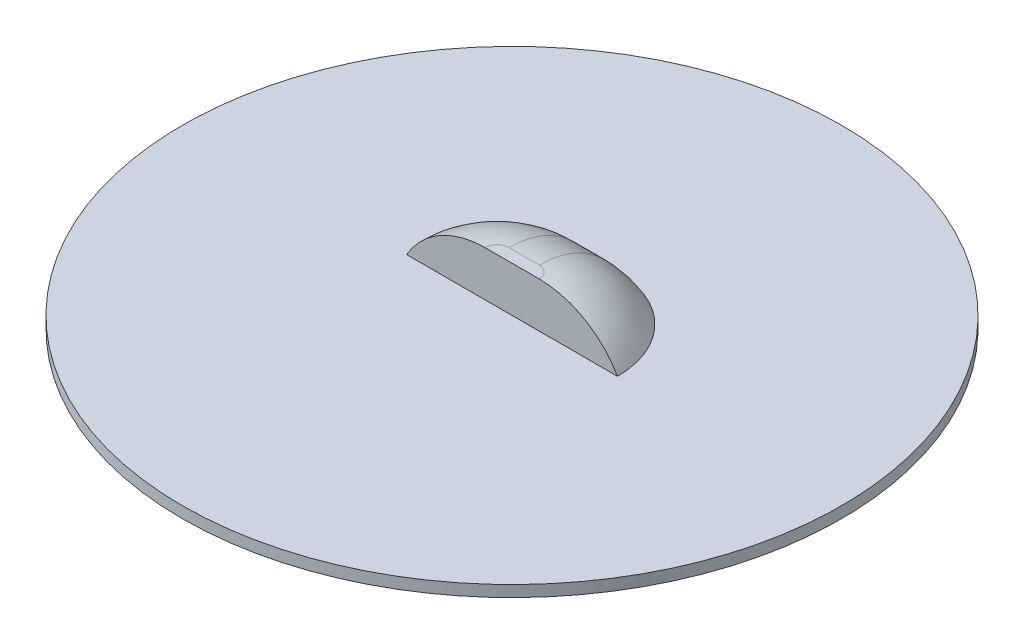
ISO-10303-21;
HEADER;
FILE_DESCRIPTION(('STEP AP214'),'2;1');
FILE_NAME('part.step','',(''),(''),'','','');
FILE_SCHEMA(('AUTOMOTIVE_DESIGN { 1 0 10303 214 1 1 1 1 }'));
ENDSEC;
DATA;
#1=APPLICATION_CONTEXT('core data for automotive mechanical design processes');
#2=APPLICATION_PROTOCOL_DEFINITION('international standard','automotive_design',2000,#1);
#3=PRODUCT_CONTEXT('',#1,'mechanical');
#4=PRODUCT('Part','Part','',(#3));
#5=PRODUCT_RELATED_PRODUCT_CATEGORY('part','',(#4));
#6=PRODUCT_DEFINITION_FORMATION('','',#4);
#7=PRODUCT_DEFINITION_CONTEXT('part definition',#1,'design');
#8=PRODUCT_DEFINITION('design','',#6,#7);
#9=PRODUCT_DEFINITION_SHAPE('','',#8);
#10=(LENGTH_UNIT() NAMED_UNIT(*) SI_UNIT(.MILLI.,.METRE.));
#11=(NAMED_UNIT(*) PLANE_ANGLE_UNIT() SI_UNIT($,.RADIAN.));
#12=(NAMED_UNIT(*) SI_UNIT($,.STERADIAN.) SOLID_ANGLE_UNIT());
#13=UNCERTAINTY_MEASURE_WITH_UNIT(LENGTH_MEASURE(1.E-05),#10,'distance_accuracy_value','');
#14=(GEOMETRIC_REPRESENTATION_CONTEXT(3) GLOBAL_UNCERTAINTY_ASSIGNED_CONTEXT((#13)) GLOBAL_UNIT_ASSIGNED_CONTEXT((#10,
#11,#12)) REPRESENTATION_CONTEXT('',''));
#15=CARTESIAN_POINT('',(0.,0.,0.));
#16=DIRECTION('',(0.,0.,1.));
#17=DIRECTION('',(1.,0.,0.));
#18=AXIS2_PLACEMENT_3D('',#15,#16,#17);
#19=CARTESIAN_POINT('',(0.,1.524,0.));
#20=DIRECTION('',(0.,1.,0.));
#21=DIRECTION('',(0.,0.,1.));
#22=AXIS2_PLACEMENT_3D('',#19,#20,#21);
#23=PLANE('',#22);
#24=CARTESIAN_POINT('',(0.,1.524,0.));
#25=DIRECTION('',(0.,1.,0.));
#26=DIRECTION('',(0.,0.,1.));
#27=AXIS2_PLACEMENT_3D('',#24,#25,#26);
#28=CIRCLE('',#27,44.45);
#29=CARTESIAN_POINT('',(0.,1.524,-44.45));
#30=VERTEX_POINT('',#29);
#31=EDGE_CURVE('E106',#30,#30,#28,.T.);
#32=ORIENTED_EDGE('',*,*,#31,.T.);
#33=EDGE_LOOP('',(#32));
#34=FACE_BOUND('',#33,.T.);
#35=DIRECTION('',(1.,0.,0.));
#36=VECTOR('',#35,1.);
#37=CARTESIAN_POINT('',(-14.2240000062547,1.524,-0.00872607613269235));
#38=LINE('',#37,#36);
#39=CARTESIAN_POINT('',(-14.2240000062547,1.524,-0.00872607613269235));
#40=VERTEX_POINT('',#39);
#41=CARTESIAN_POINT('',(14.2228102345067,1.524,-0.00872607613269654));
#42=VERTEX_POINT('',#41);
#43=EDGE_CURVE('E84',#40,#42,#38,.T.);
#44=ORIENTED_EDGE('',*,*,#43,.F.);
#45=CARTESIAN_POINT('',(-2.04191902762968,1.524,-0.00872607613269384));
#46=DIRECTION('',(0.,1.,0.));
#47=DIRECTION('',(0.,0.,1.));
#48=AXIS2_PLACEMENT_3D('',#45,#46,#47);
#49=CIRCLE('',#48,12.1820809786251);
#50=CARTESIAN_POINT('',(-2.04191902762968,1.524,-12.1908070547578));
#51=VERTEX_POINT('',#50);
#52=EDGE_CURVE('E93',#51,#40,#49,.T.);
#53=ORIENTED_EDGE('',*,*,#52,.F.);
#54=DIRECTION('',(-1.,0.,0.));
#55=VECTOR('',#54,1.);
#56=CARTESIAN_POINT('',(-2.04191902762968,1.524,-12.1908070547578));
#57=LINE('',#56,#55);
#58=CARTESIAN_POINT('',(2.0407292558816,1.524,-12.1908070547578));
#59=VERTEX_POINT('',#58);
#60=EDGE_CURVE('E104',#59,#51,#57,.T.);
#61=ORIENTED_EDGE('',*,*,#60,.F.);
#62=CARTESIAN_POINT('',(2.0407292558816,1.524,-0.00872607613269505));
#63=DIRECTION('',(0.,1.,0.));
#64=DIRECTION('',(0.,0.,1.));
#65=AXIS2_PLACEMENT_3D('',#62,#63,#64);
#66=CIRCLE('',#65,12.1820809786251);
#67=EDGE_CURVE('E95',#42,#59,#66,.T.);
#68=ORIENTED_EDGE('',*,*,#67,.F.);
#69=EDGE_LOOP('',(#44,#53,#61,#68));
#70=FACE_BOUND('',#69,.T.);
#71=ADVANCED_FACE('F38',(#34,#70),#23,.T.);
#72=CARTESIAN_POINT('',(0.,1.524,0.));
#73=DIRECTION('',(0.,-1.,0.));
#74=DIRECTION('',(0.,0.,-1.));
#75=AXIS2_PLACEMENT_3D('',#72,#73,#74);
#76=CYLINDRICAL_SURFACE('',#75,44.45);
#77=CARTESIAN_POINT('',(0.,0.,0.));
#78=DIRECTION('',(0.,1.,0.));
#79=DIRECTION('',(0.,0.,1.));
#80=AXIS2_PLACEMENT_3D('',#77,#78,#79);
#81=CIRCLE('',#80,44.45);
#82=CARTESIAN_POINT('',(0.,0.,-44.45));
#83=VERTEX_POINT('',#82);
#84=EDGE_CURVE('E110',#83,#83,#81,.T.);
#85=CARTESIAN_POINT('',(0.,1.524,-44.45));
#86=CARTESIAN_POINT('',(0.,1.508125,-44.45));
#87=CARTESIAN_POINT('',(0.,1.49225,-44.45));
#88=CARTESIAN_POINT('',(0.,1.4605,-44.45));
#89=CARTESIAN_POINT('',(0.,1.444625,-44.45));
#90=CARTESIAN_POINT('',(0.,1.412875,-44.45));
#91=CARTESIAN_POINT('',(0.,1.397,-44.45));
#92=CARTESIAN_POINT('',(0.,1.36525,-44.45));
#93=CARTESIAN_POINT('',(0.,1.349375,-44.45));
#94=CARTESIAN_POINT('',(0.,1.317625,-44.45));
#95=CARTESIAN_POINT('',(0.,1.30175,-44.45));
#96=CARTESIAN_POINT('',(0.,1.27,-44.45));
#97=CARTESIAN_POINT('',(0.,1.254125,-44.45));
#98=CARTESIAN_POINT('',(0.,1.222375,-44.45));
#99=CARTESIAN_POINT('',(0.,1.2065,-44.45));
#100=CARTESIAN_POINT('',(0.,1.17475,-44.45));
#101=CARTESIAN_POINT('',(0.,1.158875,-44.45));
#102=CARTESIAN_POINT('',(0.,1.127125,-44.45));
#103=CARTESIAN_POINT('',(0.,1.11125,-44.45));
#104=CARTESIAN_POINT('',(0.,1.0795,-44.45));
#105=CARTESIAN_POINT('',(0.,1.063625,-44.45));
#106=CARTESIAN_POINT('',(0.,1.031875,-44.45));
#107=CARTESIAN_POINT('',(0.,1.016,-44.45));
#108=CARTESIAN_POINT('',(0.,0.98425,-44.45));
#109=CARTESIAN_POINT('',(0.,0.968375,-44.45));
#110=CARTESIAN_POINT('',(0.,0.936625,-44.45));
#111=CARTESIAN_POINT('',(0.,0.92075,-44.45));
#112=CARTESIAN_POINT('',(0.,0.889,-44.45));
#113=CARTESIAN_POINT('',(0.,0.873125,-44.45));
#114=CARTESIAN_POINT('',(0.,0.841375,-44.45));
#115=CARTESIAN_POINT('',(0.,0.8255,-44.45));
#116=CARTESIAN_POINT('',(0.,0.79375,-44.45));
#117=CARTESIAN_POINT('',(0.,0.777875,-44.45));
#118=CARTESIAN_POINT('',(0.,0.746125,-44.45));
#119=CARTESIAN_POINT('',(0.,0.73025,-44.45));
#120=CARTESIAN_POINT('',(0.,0.6985,-44.45));
#121=CARTESIAN_POINT('',(0.,0.682625,-44.45));
#122=CARTESIAN_POINT('',(0.,0.650875,-44.45));
#123=CARTESIAN_POINT('',(0.,0.635,-44.45));
#124=CARTESIAN_POINT('',(0.,0.60325,-44.45));
#125=CARTESIAN_POINT('',(0.,0.587375,-44.45));
#126=CARTESIAN_POINT('',(0.,0.555625,-44.45));
#127=CARTESIAN_POINT('',(0.,0.53975,-44.45));
#128=CARTESIAN_POINT('',(0.,0.508,-44.45));
#129=CARTESIAN_POINT('',(0.,0.492125,-44.45));
#130=CARTESIAN_POINT('',(0.,0.460375,-44.45));
#131=CARTESIAN_POINT('',(0.,0.4445,-44.45));
#132=CARTESIAN_POINT('',(0.,0.41275,-44.45));
#133=CARTESIAN_POINT('',(0.,0.396875,-44.45));
#134=CARTESIAN_POINT('',(0.,0.365125,-44.45));
#135=CARTESIAN_POINT('',(0.,0.34925,-44.45));
#136=CARTESIAN_POINT('',(0.,0.3175,-44.45));
#137=CARTESIAN_POINT('',(0.,0.301625,-44.45));
#138=CARTESIAN_POINT('',(0.,0.269875,-44.45));
#139=CARTESIAN_POINT('',(0.,0.254,-44.45));
#140=CARTESIAN_POINT('',(0.,0.22225,-44.45));
#141=CARTESIAN_POINT('',(0.,0.206375,-44.45));
#142=CARTESIAN_POINT('',(0.,0.174625,-44.45));
#143=CARTESIAN_POINT('',(0.,0.15875,-44.45));
#144=CARTESIAN_POINT('',(0.,0.127,-44.45));
#145=CARTESIAN_POINT('',(0.,0.111125,-44.45));
#146=CARTESIAN_POINT('',(0.,0.079375,-44.45));
#147=CARTESIAN_POINT('',(0.,0.0635,-44.45));
#148=CARTESIAN_POINT('',(0.,0.0317499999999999,-44.45));
#149=CARTESIAN_POINT('',(0.,0.015875,-44.45));
#150=CARTESIAN_POINT('',(0.,0.,-44.45));
#151=B_SPLINE_CURVE_WITH_KNOTS('',3,(#85,#86,#87,#88,#89,#90,#91,#92,#93,#94,#95,#96,#97,#98,
#99,#100,#101,#102,#103,#104,#105,#106,#107,#108,#109,#110,#111,#112,#113,#114,#115,#116,#117,
#118,#119,#120,#121,#122,#123,#124,#125,#126,#127,#128,#129,#130,#131,#132,#133,#134,#135,#136,
#137,#138,#139,#140,#141,#142,#143,#144,#145,#146,#147,#148,#149,#150),.UNSPECIFIED.,.F.,.F.,(4,
2,2,2,2,2,2,2,2,2,2,2,2,2,2,2,2,2,2,2,2,2,2,2,2,2,2,2,2,2,2,2,4),(0.,0.0476249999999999,
0.0952499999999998,0.142875,0.1905,0.238125,0.28575,0.333375,0.381,0.428625,0.47625,0.523875,
0.5715,0.619125,0.66675,0.714375,0.762,0.809625,0.85725,0.904875,0.9525,1.000125,1.04775,
1.095375,1.143,1.190625,1.23825,1.285875,1.3335,1.381125,1.42875,1.476375,1.524),.UNSPECIFIED.);
#152=EDGE_CURVE('BSEAM126',#30,#83,#151,.T.);
#153=ORIENTED_EDGE('',*,*,#31,.F.);
#154=ORIENTED_EDGE('',*,*,#84,.T.);
#155=ORIENTED_EDGE('',*,*,#152,.T.);
#156=ORIENTED_EDGE('',*,*,#152,.F.);
#157=EDGE_LOOP('',(#153,#155,#154,#156));
#158=FACE_BOUND('',#157,.T.);
#159=ADVANCED_FACE('F126',(#158),#76,.T.);
#160=CARTESIAN_POINT('',(0.,0.,0.));
#161=DIRECTION('',(0.,1.,0.));
#162=DIRECTION('',(0.,0.,1.));
#163=AXIS2_PLACEMENT_3D('',#160,#161,#162);
#164=PLANE('',#163);
#165=ORIENTED_EDGE('',*,*,#84,.F.);
#166=EDGE_LOOP('',(#165));
#167=FACE_BOUND('',#166,.T.);
#168=ADVANCED_FACE('F132',(#167),#164,.F.);
#169=CARTESIAN_POINT('',(-14.2240000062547,7.62,-0.00872607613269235));
#170=DIRECTION('',(0.,0.,-1.));
#171=DIRECTION('',(-1.,0.,0.));
#172=AXIS2_PLACEMENT_3D('',#169,#170,#171);
#173=PLANE('',#172);
#174=ORIENTED_EDGE('',*,*,#43,.T.);
#175=CARTESIAN_POINT('',(3.66422851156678,-4.572,-0.00872607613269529));
#176=DIRECTION('',(0.,0.,-1.));
#177=DIRECTION('',(-1.,0.,0.));
#178=AXIS2_PLACEMENT_3D('',#175,#176,#177);
#179=CIRCLE('',#178,12.192);
#180=CARTESIAN_POINT('',(3.66422851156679,7.62,-0.00872607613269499));
#181=VERTEX_POINT('',#180);
#182=EDGE_CURVE('E11',#42,#181,#179,.F.);
#183=ORIENTED_EDGE('',*,*,#182,.T.);
#184=DIRECTION('',(1.,0.,0.));
#185=VECTOR('',#184,1.);
#186=CARTESIAN_POINT('',(-14.2240000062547,7.62,-0.00872607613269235));
#187=LINE('',#186,#185);
#188=CARTESIAN_POINT('',(-3.66541828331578,7.62,-0.00872607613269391));
#189=VERTEX_POINT('',#188);
#190=EDGE_CURVE('E87',#189,#181,#187,.T.);
#191=ORIENTED_EDGE('',*,*,#190,.F.);
#192=CARTESIAN_POINT('',(-3.66541828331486,-4.572,-0.0087260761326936));
#193=DIRECTION('',(0.,0.,-1.));
#194=DIRECTION('',(-1.,0.,0.));
#195=AXIS2_PLACEMENT_3D('',#192,#193,#194);
#196=CIRCLE('',#195,12.192);
#197=EDGE_CURVE('E47',#189,#40,#196,.F.);
#198=ORIENTED_EDGE('',*,*,#197,.T.);
#199=EDGE_LOOP('',(#174,#183,#191,#198));
#200=FACE_BOUND('',#199,.T.);
#201=ADVANCED_FACE('F83',(#200),#173,.F.);
#202=CARTESIAN_POINT('',(-2.04191902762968,7.62,-0.00872607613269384));
#203=DIRECTION('',(0.,1.,0.));
#204=DIRECTION('',(0.,0.,1.));
#205=AXIS2_PLACEMENT_3D('',#202,#203,#204);
#206=PLANE('',#205);
#207=ORIENTED_EDGE('',*,*,#190,.T.);
#208=CARTESIAN_POINT('',(2.0407292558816,7.62,-0.00872607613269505));
#209=DIRECTION('',(0.,1.,0.));
#210=DIRECTION('',(0.,0.,1.));
#211=AXIS2_PLACEMENT_3D('',#208,#209,#210);
#212=CIRCLE('',#211,1.62349925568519);
#213=CARTESIAN_POINT('',(2.0407292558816,7.62,-1.63222533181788));
#214=VERTEX_POINT('',#213);
#215=EDGE_CURVE('E90',#181,#214,#212,.T.);
#216=ORIENTED_EDGE('',*,*,#215,.T.);
#217=DIRECTION('',(1.,0.,0.));
#218=VECTOR('',#217,1.);
#219=CARTESIAN_POINT('',(-2.04191902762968,7.62,-1.63222533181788));
#220=LINE('',#219,#218);
#221=CARTESIAN_POINT('',(-2.04191902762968,7.62,-1.63222533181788));
#222=VERTEX_POINT('',#221);
#223=EDGE_CURVE('E62',#214,#222,#220,.F.);
#224=ORIENTED_EDGE('',*,*,#223,.T.);
#225=CARTESIAN_POINT('',(-2.04191902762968,7.62,-0.00872607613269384));
#226=DIRECTION('',(0.,1.,0.));
#227=DIRECTION('',(0.,0.,1.));
#228=AXIS2_PLACEMENT_3D('',#225,#226,#227);
#229=CIRCLE('',#228,1.62349925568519);
#230=EDGE_CURVE('E109',#222,#189,#229,.T.);
#231=ORIENTED_EDGE('',*,*,#230,.T.);
#232=EDGE_LOOP('',(#207,#216,#224,#231));
#233=FACE_BOUND('',#232,.T.);
#234=ADVANCED_FACE('F115',(#233),#206,.T.);
#235=CARTESIAN_POINT('',(-2.04191902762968,-4.572,-0.00872607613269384));
#236=DIRECTION('',(0.,-1.,0.));
#237=DIRECTION('',(0.,0.,-1.));
#238=AXIS2_PLACEMENT_3D('',#235,#236,#237);
#239=DEGENERATE_TOROIDAL_SURFACE('',#238,1.62349925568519,12.192,.T.);
#240=ORIENTED_EDGE('',*,*,#197,.F.);
#241=ORIENTED_EDGE('',*,*,#230,.F.);
#242=CARTESIAN_POINT('',(-2.04191902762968,-4.572,-1.63222533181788));
#243=DIRECTION('',(1.,0.,0.));
#244=DIRECTION('',(0.,0.,-1.));
#245=AXIS2_PLACEMENT_3D('',#242,#243,#244);
#246=CIRCLE('',#245,12.192);
#247=EDGE_CURVE('E42',#51,#222,#246,.T.);
#248=ORIENTED_EDGE('',*,*,#247,.F.);
#249=ORIENTED_EDGE('',*,*,#52,.T.);
#250=EDGE_LOOP('',(#240,#241,#248,#249));
#251=FACE_BOUND('',#250,.T.);
#252=ADVANCED_FACE('F40',(#251),#239,.T.);
#253=CARTESIAN_POINT('',(-2.04191902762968,-4.572,-1.63222533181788));
#254=DIRECTION('',(-1.,0.,0.));
#255=DIRECTION('',(0.,0.,1.));
#256=AXIS2_PLACEMENT_3D('',#253,#254,#255);
#257=CYLINDRICAL_SURFACE('',#256,12.192);
#258=ORIENTED_EDGE('',*,*,#247,.T.);
#259=ORIENTED_EDGE('',*,*,#223,.F.);
#260=CARTESIAN_POINT('',(2.0407292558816,-4.572,-1.63222533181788));
#261=DIRECTION('',(1.,0.,0.));
#262=DIRECTION('',(0.,0.,-1.));
#263=AXIS2_PLACEMENT_3D('',#260,#261,#262);
#264=CIRCLE('',#263,12.192);
#265=EDGE_CURVE('E55',#59,#214,#264,.T.);
#266=ORIENTED_EDGE('',*,*,#265,.F.);
#267=ORIENTED_EDGE('',*,*,#60,.T.);
#268=EDGE_LOOP('',(#258,#259,#266,#267));
#269=FACE_BOUND('',#268,.T.);
#270=ADVANCED_FACE('F118',(#269),#257,.T.);
#271=CARTESIAN_POINT('',(2.0407292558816,-4.572,-0.00872607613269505));
#272=DIRECTION('',(0.,-1.,0.));
#273=DIRECTION('',(0.,0.,-1.));
#274=AXIS2_PLACEMENT_3D('',#271,#272,#273);
#275=DEGENERATE_TOROIDAL_SURFACE('',#274,1.62349925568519,12.192,.T.);
#276=ORIENTED_EDGE('',*,*,#182,.F.);
#277=ORIENTED_EDGE('',*,*,#67,.T.);
#278=ORIENTED_EDGE('',*,*,#265,.T.);
#279=ORIENTED_EDGE('',*,*,#215,.F.);
#280=EDGE_LOOP('',(#276,#277,#278,#279));
#281=FACE_BOUND('',#280,.T.);
#282=ADVANCED_FACE('F116',(#281),#275,.T.);
#283=CLOSED_SHELL('',(#71,#159,#168,#201,#234,#252,#270,#282));
#284=MANIFOLD_SOLID_BREP('B2',#283);
#285=ADVANCED_BREP_SHAPE_REPRESENTATION('',(#18,#284),#14);
#286=SHAPE_DEFINITION_REPRESENTATION(#9,#285);
ENDSEC;
END-ISO-10303-21;
